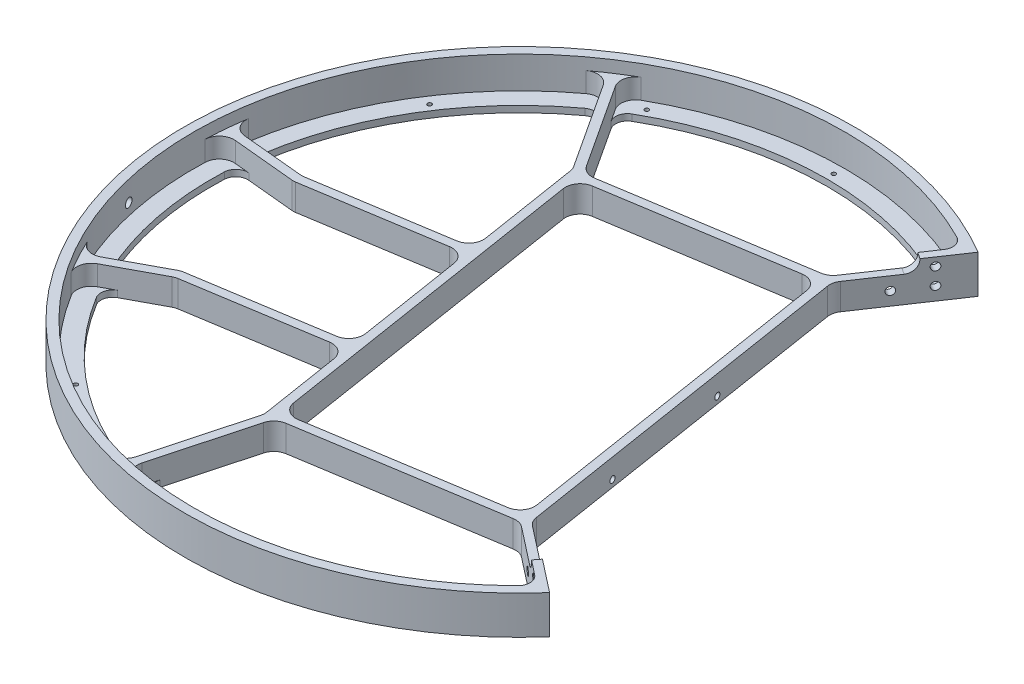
from build123d import *

# Parameters (mm, degrees)
SKETCH1_R                             = 185.42
SKETCH1_R_2                           = 180.34
EXTRUDE1_DEPTH                        = 21.209
SKETCH2_R                             = 185.42
SKETCH2_R_2                           = 170.451941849
EXTRUDE2_DEPTH                        = 3.556
CUT_EXTRUDE1_DEPTH                    = 264.079787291
EXTRUDE4_START                        = -3.556
EXTRUDE4_DEPTH                        = 21.209
EXTRUDE5_START                        = -3.556
EXTRUDE5_DEPTH                        = 21.209
FILLET1_R                             = 6.604
EXTRUDE6_DEPTH                        = 14.605
FILLET2_R                             = 8.128
SKETCH15_R                            = 2.413
EXTRUDE7_DEPTH                        = 4.191
LPATTERN5_COUNT                       = 3
LPATTERN5_PITCH                       = 61.2775
LPATTERN5_COUNT_DIR2                  = 4
LPATTERN5_PITCH_DIR2                  = 66.8274
SKETCH16_R                            = 2.413
EXTRUDE8_DEPTH                        = 4.191
CIRPATTERN3_COUNT                     = 10
CIRPATTERN3_ANGLE                     = 253.822
SKETCH17_R                            = 2.412999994
SKETCH17_R_2                          = 2.413
EXTRUDE9_DEPTH                        = 4.191
F_4_40_TAPPED_HOLE4_D                 = 2.2606
F_4_40_TAPPED_HOLE5_D                 = 2.2606
F_4_40_TAPPED_HOLE5_DEPTH             = 13.843
F_4_40_TAPPED_HOLE5_TIP               = 0.679152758
FILLET4_R                             = 6.35
SKETCH22_R                            = 204.054060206
CUT_EXTRUDE2_DEPTH                    = 264.079787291
FILLET5_R                             = 6.604
SKETCH23_W                            = 2.15265
SKETCH23_H                            = 234.216375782
F_18_0_1695_DIAMETER_HOLE1_AT_2_COUNT = 2
F_18_0_1695_DIAMETER_HOLE1_AT_2_PITCH = 20.306601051
F_18_0_1695_DIAMETER_HOLE1_AT_3_COUNT = 2
F_18_0_1695_DIAMETER_HOLE1_AT_3_PITCH = 18.034
SKETCH25_W                            = 2.15265
SKETCH25_H                            = 246.937762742
F_18_0_1695_DIAMETER_HOLE2_AT_2_COUNT = 2
F_18_0_1695_DIAMETER_HOLE2_AT_2_PITCH = 20.306601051
F_18_0_1695_DIAMETER_HOLE2_AT_3_COUNT = 2
F_18_0_1695_DIAMETER_HOLE2_AT_3_PITCH = 9.3345
CUT_EXTRUDE4_REACH                    = 392.463
CUT_EXTRUDE4_END_RADIUS               = 180.34
SKETCH28_R                            = 2.413
CUT_EXTRUDE5_REACH                    = 331.852
SKETCH36_R                            = 1.7272


with BuildPart() as part:
    # Sketch1 → Extrude1 (new body)
    with BuildSketch(Plane(origin=(0, 0, 0), x_dir=(1, 0, 0), z_dir=(0, 1, 0))):
        with Locations(Location((0, 0, 0), (0, 0, 270))):
            Circle(SKETCH1_R)
        with Locations(Location((0, 0, 0), (0, 0, 270))):
            Circle(SKETCH1_R_2, mode=Mode.SUBTRACT)
    extrude(amount=EXTRUDE1_DEPTH)

    # Sketch2 → Extrude2 (add)
    with BuildSketch(Plane.XZ):
        with Locations(Location((0, 0, 0), (0, 0, 90))):
            Circle(SKETCH2_R)
        with Locations(Location((0, 0, 0), (0, 0, 270))):
            Circle(SKETCH2_R_2, mode=Mode.SUBTRACT)
    extrude(amount=-EXTRUDE2_DEPTH)

    # Sketch3 → Cut-Extrude1 (cut, through all)
    with BuildSketch(Plane(origin=(0, 21.209, 0), x_dir=(-1, 0, 0), z_dir=(0, 1, 0))):
        with BuildLine():
            Line((-139.219055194, 122.468898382), (14.578576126, 2.309019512))
            Line((14.578576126, 2.309019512), (-94.560218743, -159.495897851))
            ThreePointArc((-94.560218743, -159.495897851), (-183.137172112, -29.006078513), (-139.219055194, 122.468898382))
        make_face()
    extrude(amount=-CUT_EXTRUDE1_DEPTH, mode=Mode.SUBTRACT)

    # Sketch5 → Extrude4 (add)
    with BuildSketch(Plane(origin=(0, 3.556, 0), x_dir=(-1, 0, 0), z_dir=(0, 1, 0)).offset(EXTRUDE4_START)):
        with BuildLine():
            Line((-81.598201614, -140.27891719), (-78.018417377, -142.693512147))
            Line((-78.018417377, -142.693512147), (-87.960867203, -157.433800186))
            ThreePointArc((-87.960867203, -157.433800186), (-89.844183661, -156.366678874), (-91.714555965, -155.277029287))
            Line((-91.714555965, -155.277029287), (-81.598201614, -140.27891719))
        make_face()
    extrude(amount=EXTRUDE4_DEPTH)

    # Sketch6 → Extrude5 (add)
    with BuildSketch(Plane(origin=(0, 3.556, 0), x_dir=(-1, 0, 0), z_dir=(0, 1, 0)).offset(EXTRUDE5_START)):
        Polygon((-135.208966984, 119.3358741), (-121.19813579, 108.389413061), (-118.539709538, 111.792043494), (-132.550540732, 122.738504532), align=None)
    extrude(amount=EXTRUDE5_DEPTH)

    # Fillet1
    fillet1_edges = [part.edges().sort_by_distance(p)[0] for p in [
        (82.410877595, 1.778, -149.205602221),
        (87.960867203, 12.3825, -157.433800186),
        (132.305475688, 12.3825, 122.547038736),
        (124.484468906, 1.778, 116.436598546),
    ]]
    fillet(fillet1_edges, radius=FILLET1_R)

    # Sketch7 → Extrude6 (add)
    with BuildSketch(Plane.XZ):
        with BuildLine():
            Line((93.421941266, 86.688271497), (62.061396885, -111.314413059))
            Line((62.061396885, -111.314413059), (91.714555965, -155.277029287))
            ThreePointArc((91.714555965, -155.277029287), (89.844183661, -156.366678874), (87.960867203, -157.433800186))
            Line((87.960867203, -157.433800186), (58.07494577, -113.126099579))
            Line((58.07494577, -113.126099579), (-58.936820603, -94.593256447))
            Line((-58.936820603, -94.593256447), (-96.62865882, -152.267586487))
            ThreePointArc((-96.62865882, -152.267586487), (-98.657391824, -150.961036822), (-100.668461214, -149.627459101))
            Line((-100.668461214, -149.627459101), (-64.182360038, -93.798092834))
            Line((-64.182360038, -93.798092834), (-53.829335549, -28.431668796))
            Line((-53.829335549, -28.431668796), (-135.816639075, -15.446155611))
            Line((-135.816639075, -15.446155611), (-179.270370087, -19.612496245))
            ThreePointArc((-179.270370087, -19.612496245), (-179.516742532, -17.212052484), (-179.730974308, -14.808527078))
            Line((-179.730974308, -14.808527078), (-135.66709067, -10.583685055))
            Line((-135.66709067, -10.583685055), (-53.074382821, -23.665084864))
            Line((-53.074382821, -23.665084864), (-41.313028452, 50.593184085))
            Line((-41.313028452, 50.593184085), (-123.885909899, 63.671443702))
            Line((-123.885909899, 63.671443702), (-160.069558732, 83.06775528))
            ThreePointArc((-160.069558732, 83.06775528), (-158.943759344, 85.202094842), (-157.789502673, 87.321179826))
            Line((-157.789502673, 87.321179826), (-122.325023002, 68.310380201))
            Line((-122.325023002, 68.310380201), (-40.558075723, 55.359768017))
            Line((-40.558075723, 55.359768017), (-32.018110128, 109.278988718))
            Line((-32.018110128, 109.278988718), (-49.353527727, 173.455310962))
            ThreePointArc((-49.353527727, 173.455310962), (-47.028228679, 174.10014735), (-44.694509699, 174.713812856))
            Line((-44.694509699, 174.713812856), (-26.79757616, 108.458738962))
            Line((-26.79757616, 108.458738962), (90.495324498, 89.881368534))
            Line((90.495324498, 89.881368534), (132.305475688, 122.547038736))
            ThreePointArc((132.305475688, 122.547038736), (133.766857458, 120.950169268), (135.208966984, 119.3358741))
            Line((135.208966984, 119.3358741), (93.421941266, 86.688271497))
        make_face()
        Polygon((88.322145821, 85.339409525), (57.672289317, -108.176168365), (-58.655315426, -89.75168579), (-28.005458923, 103.7638921), align=None, mode=Mode.SUBTRACT)
    extrude(amount=-EXTRUDE6_DEPTH)

    # Fillet2
    fillet2_edges = [part.edges().sort_by_distance(p)[0] for p in [
        (-58.936820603, 7.3025, -94.593256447),
        (-96.62865882, 9.0805, -152.267586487),
        (-100.668461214, 9.0805, -149.627459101),
        (-135.816639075, 7.3025, -15.446155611),
        (-179.270370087, 9.0805, -19.612496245),
        (-179.730974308, 9.0805, -14.808527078),
        (-123.885909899, 7.3025, 63.671443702),
        (-160.069558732, 9.0805, 83.06775528),
        (-157.789502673, 9.0805, 87.321179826),
        (-32.018110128, 7.3025, 109.278988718),
        (-49.353527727, 9.0805, 173.455310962),
        (-44.694509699, 9.0805, 174.713812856),
        (62.061396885, 7.3025, -111.314413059),
        (90.495324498, 7.3025, 89.881368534),
        (58.07494577, 7.3025, -113.126099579),
        (-64.182360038, 7.3025, -93.798092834),
        (-53.829335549, 7.3025, -28.431668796),
        (-135.66709067, 7.3025, -10.583685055),
        (-53.074382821, 7.3025, -23.665084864),
        (-41.313028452, 7.3025, 50.593184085),
        (-122.325023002, 7.3025, 68.310380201),
        (-40.558075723, 7.3025, 55.359768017),
        (-26.79757616, 7.3025, 108.458738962),
        (93.421941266, 7.3025, 86.688271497),
        (88.322145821, 7.3025, 85.339409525),
        (57.672289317, 7.3025, -108.176168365),
        (-58.655315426, 7.3025, -89.75168579),
        (-28.005458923, 7.3025, 103.7638921),
    ]]
    fillet(fillet2_edges, radius=FILLET2_R)

    # Sketch15 → Extrude7 (add)
    with BuildSketch(Plane.XZ):
        with Locations(Location((59.678104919, -110.936936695, 0), (0, 0, 90))):
            Circle(SKETCH15_R)
    extrude7 = extrude(amount=EXTRUDE7_DEPTH)

    # LPattern5: Extrude7 3 × 4, 4 skipped
    with Locations(*[Vector(-0.9876883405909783, 0, 0.1564344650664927) * (i * LPATTERN5_PITCH) + Vector(0.1564344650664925, 0, 0.9876883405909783) * (j * LPATTERN5_PITCH_DIR2) for i in range(LPATTERN5_COUNT) for j in range(LPATTERN5_COUNT_DIR2) if (i, j) not in ((0, 0), (1, 1), (1, 2), (2, 1), (2, 2))]):
        add(extrude7)

    # Sketch16 → Extrude8 (add)
    with BuildSketch(Plane.XZ):
        with Locations(Location((82.041094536, -154.296857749, 0), (0, 0, 90))):
            Circle(SKETCH16_R)
    extrude8 = extrude(amount=EXTRUDE8_DEPTH)

    # CirPattern3: Extrude8 ×10 about axis
    cirpattern3_axis = Axis((0, 0, 0), (0, 1, 0))
    for i in range(1, CIRPATTERN3_COUNT):
        add(extrude8.rotate(cirpattern3_axis, i * CIRPATTERN3_ANGLE / (CIRPATTERN3_COUNT - 1)))

    # Sketch17 → Extrude9 (add)
    with BuildSketch(Plane.XZ):
        with Locations((-50.691603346, -24.045796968)):
            Circle(SKETCH17_R)
        with Locations((-39.171427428, 48.68973117)):
            Circle(SKETCH17_R_2)
        with Locations((-123.224762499, 65.99091196)):
            Circle(SKETCH17_R_2)
        with Locations((-135.738057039, -13.014920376)):
            Circle(SKETCH17_R_2)
    extrude(amount=EXTRUDE9_DEPTH)

    # 4-40 Tapped Hole4 (through all)
    with Locations(Plane.XZ.offset(4.191)):
        with Locations((125.328333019, 121.782882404), (52.89659256, 166.553931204), (-32.094566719, 171.779510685), (-109.465403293, 136.218893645), (-160.845494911, 68.315358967), (-145.903645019, -96.178936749), (-83.129398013, -153.713254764), (-0.617453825, -174.750909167), (82.041094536, -154.296857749)):
            Hole(F_4_40_TAPPED_HOLE4_D / 2)

    # 4-40 Tapped Hole5
    with Locations(Plane.XZ.offset(4.191)):
        with Locations((-30.00571395, 106.248820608), (-123.224762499, 65.99091196), (-135.738057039, -13.014920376), (-61.368039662, -91.765110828), (-0.844967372, -101.351023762), (59.678104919, -110.936936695), (70.13221349, -44.932292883), (80.58632206, 21.072350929), (-50.691603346, -24.045796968), (-39.171427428, 48.68973117), (30.517358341, 96.662907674), (91.040430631, 87.076994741), (-174.035490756, -15.808524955)):
            Hole(F_4_40_TAPPED_HOLE5_D / 2, depth=F_4_40_TAPPED_HOLE5_DEPTH)
            with Locations((0, 0, -(F_4_40_TAPPED_HOLE5_DEPTH + F_4_40_TAPPED_HOLE5_TIP / 2))):  # 118° drill point
                Cone(0, F_4_40_TAPPED_HOLE5_D / 2, F_4_40_TAPPED_HOLE5_TIP, mode=Mode.SUBTRACT)

    # Fillet4
    fillet4_edges = [part.edges().sort_by_distance(p)[0] for p in [
        (79.808309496, 14.605, -141.486214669),
        (119.868922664, 14.605, 110.090728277),
    ]]
    fillet(fillet4_edges, radius=FILLET4_R)

    # Sketch22 → Cut-Extrude2 (cut, through all)
    with BuildSketch(Plane(origin=(0, 0, 0), x_dir=(1, 0, 0), z_dir=(0, 1, 0))):
        Circle(SKETCH22_R)
    extrude(amount=-CUT_EXTRUDE2_DEPTH, mode=Mode.SUBTRACT)

    # Fillet5
    fillet5_edges = [part.edges().sort_by_distance(p)[0] for p in [
        (-91.218752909, 1.778, -143.989595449),
        (-95.258555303, 1.778, -141.349468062),
        (-169.426518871, 1.778, -18.668668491),
        (-169.887123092, 1.778, -13.864699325),
        (-151.353832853, 1.778, 78.395674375),
        (-149.073776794, 1.778, 82.649098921),
        (-46.774721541, 1.778, 163.908480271),
        (-42.115703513, 1.778, 165.166982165),
    ]]
    fillet(fillet5_edges, radius=FILLET5_R)

    # Sketch23 → 18 _0.1695_ Diameter Hole1 (revolve, cut)
    with BuildSketch(Plane(origin=(71.413438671, 7.3025, -132.901228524), x_dir=(-0.5591929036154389, 0, 0.8290375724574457), z_dir=(0, 1, 0))):
        with Locations((1.076325, 117.108187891)):
            Rectangle(SKETCH23_W, SKETCH23_H)
    f_18_0_1695_diameter_hole1 = revolve(axis=Axis((66.149050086, 7.3025, -136.452103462), (0.8290375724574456, 0, 0.559192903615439)), mode=Mode.SUBTRACT)

    # 18 _0.1695_ Diameter Hole1 at 2: 18 _0.1695_ Diameter Hole1 ×2
    with Locations(*[Vector(0.4966111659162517, 0.45967811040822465, -0.7362563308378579) * (i * F_18_0_1695_DIAMETER_HOLE1_AT_2_PITCH) for i in range(1, F_18_0_1695_DIAMETER_HOLE1_AT_2_COUNT)]):
        add(f_18_0_1695_diameter_hole1, mode=Mode.SUBTRACT)

    # 18 _0.1695_ Diameter Hole1 at 3: 18 _0.1695_ Diameter Hole1 ×2
    with Locations(*[Vector(0.559192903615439, 0, -0.8290375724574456) * (i * F_18_0_1695_DIAMETER_HOLE1_AT_3_PITCH) for i in range(1, F_18_0_1695_DIAMETER_HOLE1_AT_3_COUNT)]):
        add(f_18_0_1695_diameter_hole1, mode=Mode.SUBTRACT)

    # Sketch25 → 18 _0.1695_ Diameter Hole2 (revolve, cut)
    with BuildSketch(Plane(origin=(123.197940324, 16.637, 115.431452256), x_dir=(0.7880107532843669, 0, 0.6156614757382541), z_dir=(0, 1, 0))):
        with Locations((1.076325, 123.468881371)):
            Rectangle(SKETCH25_W, SKETCH25_H)
    f_18_0_1695_diameter_hole2 = revolve(axis=Axis((119.288489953, 16.637, 120.435320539), (0.6156614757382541, 0, -0.7880107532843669)), mode=Mode.SUBTRACT)

    # 18 _0.1695_ Diameter Hole2 at 2: 18 _0.1695_ Diameter Hole2 ×2
    with Locations(*[Vector(-0.69982100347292, -0.4596781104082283, -0.5467600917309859) * (i * F_18_0_1695_DIAMETER_HOLE2_AT_2_PITCH) for i in range(1, F_18_0_1695_DIAMETER_HOLE2_AT_2_COUNT)]):
        add(f_18_0_1695_diameter_hole2, mode=Mode.SUBTRACT)

    # 18 _0.1695_ Diameter Hole2 at 3: 18 _0.1695_ Diameter Hole2 ×2
    with Locations(*[(0, -i * F_18_0_1695_DIAMETER_HOLE2_AT_3_PITCH, 0) for i in range(1, F_18_0_1695_DIAMETER_HOLE2_AT_3_COUNT)]):
        add(f_18_0_1695_diameter_hole2, mode=Mode.SUBTRACT)

    # Cut-Extrude4: up to this cylinder (the profile starts outside it)
    cut_extrude4_end = Plane(origin=(0, 9.906, 0), z_dir=(0, -1, 0)) * Cylinder(CUT_EXTRUDE4_END_RADIUS, 1146.606, mode=Mode.PRIVATE)
    # Sketch28 → Cut-Extrude4 (cut, up to the surface)
    with BuildSketch(Plane(origin=(-186.099164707, 0, 29.475212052), x_dir=(-0.15643446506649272, 0, -0.9876883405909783), z_dir=(0.9876883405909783, 0, -0.15643446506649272)), mode=Mode.PRIVATE) as cut_extrude4_sk1:
        with Locations(Location((-12.7, 9.906, 0), (0, 0, 180))):
            Circle(SKETCH28_R)
    cut_extrude4_tool1 = extrude(cut_extrude4_sk1.sketch, amount=CUT_EXTRUDE4_REACH, mode=Mode.PRIVATE) - cut_extrude4_end
    add(cut_extrude4_tool1.solids().sort_by_distance((-184.112447, 9.906, 42.018854))[0], mode=Mode.SUBTRACT)

    # Sketch36 → Cut-Extrude5 (cut, up to next)
    with BuildSketch(Plane(origin=(77.741669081, 0, -12.313070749), x_dir=(-0.15643446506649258, 0, -0.9876883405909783), z_dir=(0.9876883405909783, 0, -0.15643446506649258)), mode=Mode.PRIVATE) as cut_extrude5_sk1:
        with Locations((-46.233702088, 3.81)):
            Circle(SKETCH36_R)
    cut_extrude5_tool1 = extrude(cut_extrude5_sk1.sketch, amount=-CUT_EXTRUDE5_REACH, mode=Mode.PRIVATE) & part.part
    # Sketch36 → Cut-Extrude5 (cut, up to next)
    with BuildSketch(Plane(origin=(77.741669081, 0, -12.313070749), x_dir=(-0.15643446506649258, 0, -0.9876883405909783), z_dir=(0.9876883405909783, 0, -0.15643446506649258)), mode=Mode.PRIVATE) as cut_extrude5_sk2:
        with Locations((23.616297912, 3.81)):
            Circle(SKETCH36_R)
    cut_extrude5_tool2 = extrude(cut_extrude5_sk2.sketch, amount=-CUT_EXTRUDE5_REACH, mode=Mode.PRIVATE) & part.part
    add(cut_extrude5_tool1.solids().sort_by_distance((84.974214, 3.81, 33.351418))[0], mode=Mode.SUBTRACT)
    add(cut_extrude5_tool2.solids().sort_by_distance((74.047266, 3.81, -35.638613))[0], mode=Mode.SUBTRACT)


solid = part.part
